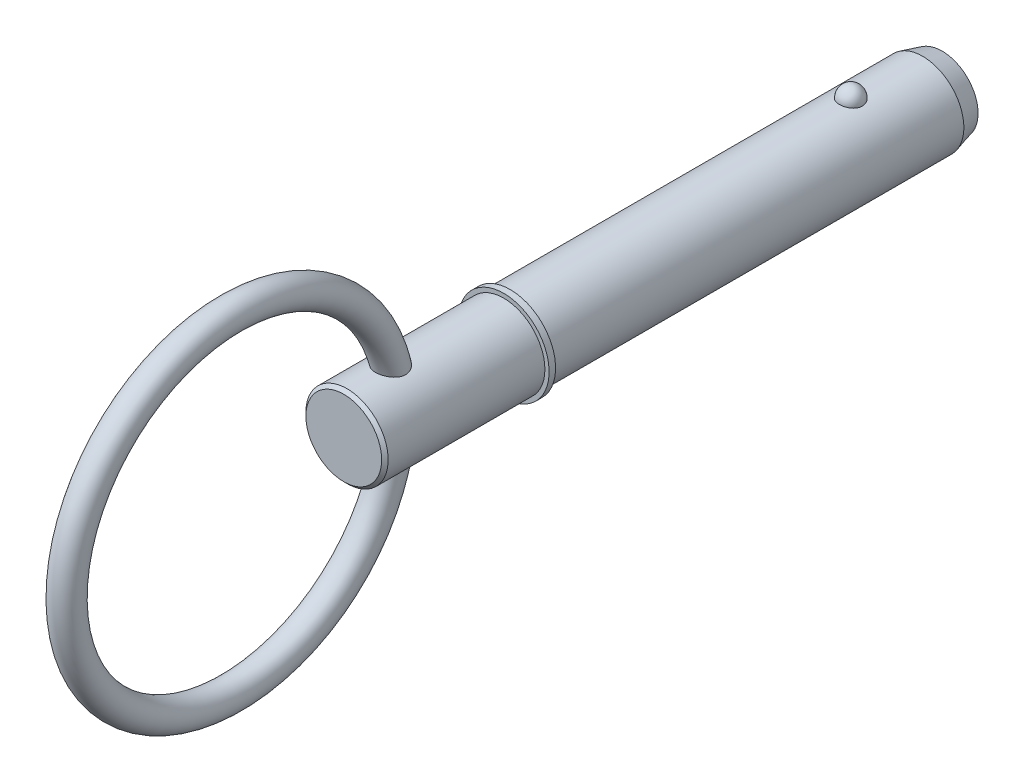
ISO-10303-21;
HEADER;
FILE_DESCRIPTION(('STEP AP214'),'2;1');
FILE_NAME('part.step','',(''),(''),'','','');
FILE_SCHEMA(('AUTOMOTIVE_DESIGN { 1 0 10303 214 1 1 1 1 }'));
ENDSEC;
DATA;
#1=APPLICATION_CONTEXT('core data for automotive mechanical design processes');
#2=APPLICATION_PROTOCOL_DEFINITION('international standard','automotive_design',2000,#1);
#3=PRODUCT_CONTEXT('',#1,'mechanical');
#4=PRODUCT('Part','Part','',(#3));
#5=PRODUCT_RELATED_PRODUCT_CATEGORY('part','',(#4));
#6=PRODUCT_DEFINITION_FORMATION('','',#4);
#7=PRODUCT_DEFINITION_CONTEXT('part definition',#1,'design');
#8=PRODUCT_DEFINITION('design','',#6,#7);
#9=PRODUCT_DEFINITION_SHAPE('','',#8);
#10=(LENGTH_UNIT() NAMED_UNIT(*) SI_UNIT(.MILLI.,.METRE.));
#11=(NAMED_UNIT(*) PLANE_ANGLE_UNIT() SI_UNIT($,.RADIAN.));
#12=(NAMED_UNIT(*) SI_UNIT($,.STERADIAN.) SOLID_ANGLE_UNIT());
#13=UNCERTAINTY_MEASURE_WITH_UNIT(LENGTH_MEASURE(1.E-05),#10,'distance_accuracy_value','');
#14=(GEOMETRIC_REPRESENTATION_CONTEXT(3) GLOBAL_UNCERTAINTY_ASSIGNED_CONTEXT((#13)) GLOBAL_UNIT_ASSIGNED_CONTEXT((#10,
#11,#12)) REPRESENTATION_CONTEXT('',''));
#15=CARTESIAN_POINT('',(0.,0.,0.));
#16=DIRECTION('',(0.,0.,1.));
#17=DIRECTION('',(1.,0.,0.));
#18=AXIS2_PLACEMENT_3D('',#15,#16,#17);
#19=CARTESIAN_POINT('',(0.,0.,50.8));
#20=DIRECTION('',(0.,0.,-1.));
#21=DIRECTION('',(-1.,0.,0.));
#22=AXIS2_PLACEMENT_3D('',#19,#20,#21);
#23=CYLINDRICAL_SURFACE('',#22,6.35);
#24=CARTESIAN_POINT('',(1.76243001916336,6.10051968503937,-1.78));
#25=CARTESIAN_POINT('',(1.76242835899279,6.10052111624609,-1.68050311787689));
#26=CARTESIAN_POINT('',(1.75431593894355,6.1028816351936,-1.58098521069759));
#27=CARTESIAN_POINT('',(1.72206027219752,6.11206037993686,-1.38476972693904));
#28=CARTESIAN_POINT('',(1.69791106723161,6.11888026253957,-1.28807321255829));
#29=CARTESIAN_POINT('',(1.63419596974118,6.13620287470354,-1.10029899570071));
#30=CARTESIAN_POINT('',(1.59463684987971,6.14670398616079,-1.00921884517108));
#31=CARTESIAN_POINT('',(1.50108569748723,6.17021534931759,-0.835161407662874));
#32=CARTESIAN_POINT('',(1.44709398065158,6.18322554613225,-0.752183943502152));
#33=CARTESIAN_POINT('',(1.3257243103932,6.21038081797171,-0.596209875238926));
#34=CARTESIAN_POINT('',(1.2582815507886,6.22453118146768,-0.523264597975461));
#35=CARTESIAN_POINT('',(1.11191624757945,6.25233390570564,-0.389855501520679));
#36=CARTESIAN_POINT('',(1.03299369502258,6.26598626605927,-0.329391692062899));
#37=CARTESIAN_POINT('',(0.866022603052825,6.29123226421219,-0.222793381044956));
#38=CARTESIAN_POINT('',(0.778000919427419,6.30283170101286,-0.176618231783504));
#39=CARTESIAN_POINT('',(0.59510847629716,6.32272058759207,-0.0996905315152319));
#40=CARTESIAN_POINT('',(0.500238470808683,6.33101040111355,-0.0689362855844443));
#41=CARTESIAN_POINT('',(0.308164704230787,6.34323464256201,-0.0241595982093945));
#42=CARTESIAN_POINT('',(0.211033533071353,6.34724467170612,-0.00984637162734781));
#43=CARTESIAN_POINT('',(0.0156629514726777,6.3507318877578,0.00262058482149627));
#44=CARTESIAN_POINT('',(-0.0825763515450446,6.35020951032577,0.000775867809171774));
#45=CARTESIAN_POINT('',(-0.275890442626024,6.34473055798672,-0.018872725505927));
#46=CARTESIAN_POINT('',(-0.370990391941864,6.3398374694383,-0.0364481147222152));
#47=CARTESIAN_POINT('',(-0.556805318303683,6.32622723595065,-0.0867447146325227));
#48=CARTESIAN_POINT('',(-0.647520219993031,6.31751002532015,-0.119466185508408));
#49=CARTESIAN_POINT('',(-0.822606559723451,6.29711353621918,-0.199386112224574));
#50=CARTESIAN_POINT('',(-0.906938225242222,6.28541739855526,-0.246667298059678));
#51=CARTESIAN_POINT('',(-1.06646479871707,6.26032612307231,-0.354365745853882));
#52=CARTESIAN_POINT('',(-1.14165877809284,6.24693081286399,-0.414784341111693));
#53=CARTESIAN_POINT('',(-1.2823514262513,6.21959142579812,-0.548435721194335));
#54=CARTESIAN_POINT('',(-1.34763761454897,6.2056417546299,-0.621891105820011));
#55=CARTESIAN_POINT('',(-1.4651153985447,6.17896241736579,-0.778815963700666));
#56=CARTESIAN_POINT('',(-1.51730606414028,6.16623283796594,-0.862286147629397));
#57=CARTESIAN_POINT('',(-1.60782211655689,6.14325839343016,-1.0379915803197));
#58=CARTESIAN_POINT('',(-1.64598111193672,6.13304379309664,-1.13031660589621));
#59=CARTESIAN_POINT('',(-1.70661885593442,6.11644899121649,-1.32030667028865));
#60=CARTESIAN_POINT('',(-1.72909805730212,6.11006867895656,-1.41797155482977));
#61=CARTESIAN_POINT('',(-1.75775019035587,6.1018881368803,-1.61543246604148));
#62=CARTESIAN_POINT('',(-1.76399136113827,6.10006874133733,-1.71521779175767));
#63=CARTESIAN_POINT('',(-1.76020715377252,6.10116172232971,-1.91445126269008));
#64=CARTESIAN_POINT('',(-1.75018221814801,6.10407397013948,-2.01389941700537));
#65=CARTESIAN_POINT('',(-1.71421005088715,6.11427232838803,-2.20912106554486));
#66=CARTESIAN_POINT('',(-1.68834262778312,6.12153651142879,-2.30491043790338));
#67=CARTESIAN_POINT('',(-1.62139543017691,6.1396067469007,-2.49066180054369));
#68=CARTESIAN_POINT('',(-1.5803150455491,6.15041294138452,-2.58062355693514));
#69=CARTESIAN_POINT('',(-1.48369112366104,6.17443456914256,-2.75271428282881));
#70=CARTESIAN_POINT('',(-1.42806998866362,6.18766281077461,-2.83479789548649));
#71=CARTESIAN_POINT('',(-1.30386620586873,6.21501934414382,-2.98832532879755));
#72=CARTESIAN_POINT('',(-1.23528306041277,6.22914767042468,-3.05976874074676));
#73=CARTESIAN_POINT('',(-1.08663999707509,6.25679135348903,-3.19029656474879));
#74=CARTESIAN_POINT('',(-1.00653826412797,6.27030422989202,-3.24933392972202));
#75=CARTESIAN_POINT('',(-0.837212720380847,6.29514770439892,-3.35304657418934));
#76=CARTESIAN_POINT('',(-0.747989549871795,6.30647845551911,-3.39772286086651));
#77=CARTESIAN_POINT('',(-0.564098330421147,6.32556124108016,-3.47096393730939));
#78=CARTESIAN_POINT('',(-0.469512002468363,6.33335611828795,-3.49972259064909));
#79=CARTESIAN_POINT('',(-0.27663389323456,6.34470628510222,-3.54113722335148));
#80=CARTESIAN_POINT('',(-0.17834256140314,6.34826208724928,-3.55379514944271));
#81=CARTESIAN_POINT('',(0.0171660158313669,6.35071525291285,-3.56255473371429));
#82=CARTESIAN_POINT('',(0.114368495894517,6.34969931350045,-3.55896450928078));
#83=CARTESIAN_POINT('',(0.306746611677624,6.34331695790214,-3.53603383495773));
#84=CARTESIAN_POINT('',(0.401922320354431,6.33795069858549,-3.51669395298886));
#85=CARTESIAN_POINT('',(0.587203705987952,6.32347219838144,-3.4629173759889));
#86=CARTESIAN_POINT('',(0.677327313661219,6.31437430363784,-3.42853846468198));
#87=CARTESIAN_POINT('',(0.850462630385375,6.29339543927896,-3.34564128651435));
#88=CARTESIAN_POINT('',(0.933473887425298,6.2815142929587,-3.29712212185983));
#89=CARTESIAN_POINT('',(1.09144542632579,6.25601750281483,-3.18638742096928));
#90=CARTESIAN_POINT('',(1.16626195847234,6.24237795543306,-3.12397237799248));
#91=CARTESIAN_POINT('',(1.304448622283,6.21497285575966,-2.98755865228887));
#92=CARTESIAN_POINT('',(1.36781676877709,6.20120728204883,-2.91355796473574));
#93=CARTESIAN_POINT('',(1.48252779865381,6.17479923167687,-2.75456133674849));
#94=CARTESIAN_POINT('',(1.53364167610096,6.16218052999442,-2.66939613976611));
#95=CARTESIAN_POINT('',(1.62109397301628,6.13975602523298,-2.49147502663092));
#96=CARTESIAN_POINT('',(1.657437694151,6.12994921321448,-2.39872184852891));
#97=CARTESIAN_POINT('',(1.71127844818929,6.11512175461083,-2.21887622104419));
#98=CARTESIAN_POINT('',(1.73042646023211,6.10968903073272,-2.13230770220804));
#99=CARTESIAN_POINT('',(1.75600284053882,6.10238739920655,-1.95716498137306));
#100=CARTESIAN_POINT('',(1.76243149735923,6.10051841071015,-1.86859082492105));
#101=CARTESIAN_POINT('',(1.76243001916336,6.10051968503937,-1.78));
#102=B_SPLINE_CURVE_WITH_KNOTS('',3,(#24,#25,#26,#27,#28,#29,#30,#31,#32,#33,#34,#35,#36,#37,
#38,#39,#40,#41,#42,#43,#44,#45,#46,#47,#48,#49,#50,#51,#52,#53,#54,#55,#56,#57,#58,#59,#60,#61,
#62,#63,#64,#65,#66,#67,#68,#69,#70,#71,#72,#73,#74,#75,#76,#77,#78,#79,#80,#81,#82,#83,#84,#85,
#86,#87,#88,#89,#90,#91,#92,#93,#94,#95,#96,#97,#98,#99,#100,#101),.UNSPECIFIED.,.T.,.F.,(4,2,2,
2,2,2,2,2,2,2,2,2,2,2,2,2,2,2,2,2,2,2,2,2,2,2,2,2,2,2,2,2,2,2,2,2,2,2,4),(0.,0.298172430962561,
0.596455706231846,0.894608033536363,1.19275383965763,1.49237238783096,1.79199116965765,
2.09074960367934,2.38947519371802,2.68283180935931,2.97616022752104,3.26529599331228,
3.5544367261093,3.84525169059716,4.13609618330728,4.43249276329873,4.72891038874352,
5.02873757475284,5.32855610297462,5.62711261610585,5.92566100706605,6.22271765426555,
6.519786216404,6.81847366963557,7.11717259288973,7.41698459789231,7.71677557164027,
8.01283014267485,8.30884891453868,8.59927798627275,8.88969658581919,9.17900899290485,
9.46833977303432,9.76212836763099,10.0559678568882,10.3549321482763,10.6537890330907,
10.9192841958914,11.1847733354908),.UNSPECIFIED.);
#103=CARTESIAN_POINT('',(1.76243001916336,6.10051968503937,-1.78));
#104=VERTEX_POINT('',#103);
#105=EDGE_CURVE('E102',#104,#104,#102,.T.);
#106=ORIENTED_EDGE('',*,*,#105,.T.);
#107=EDGE_LOOP('',(#106));
#108=FACE_BOUND('',#107,.T.);
#109=CARTESIAN_POINT('',(0.,0.,-12.8799999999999));
#110=DIRECTION('',(0.,0.,-1.));
#111=DIRECTION('',(-1.,0.,0.));
#112=AXIS2_PLACEMENT_3D('',#109,#110,#111);
#113=CIRCLE('',#112,6.35);
#114=CARTESIAN_POINT('',(-6.35,0.,-12.8799999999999));
#115=VERTEX_POINT('',#114);
#116=EDGE_CURVE('E110',#115,#115,#113,.F.);
#117=ORIENTED_EDGE('',*,*,#116,.T.);
#118=EDGE_LOOP('',(#117));
#119=FACE_BOUND('',#118,.T.);
#120=CARTESIAN_POINT('',(0.,0.,50.8));
#121=DIRECTION('',(0.,0.,1.));
#122=DIRECTION('',(1.,0.,0.));
#123=AXIS2_PLACEMENT_3D('',#120,#121,#122);
#124=CIRCLE('',#123,6.35);
#125=CARTESIAN_POINT('',(6.35,0.,50.8));
#126=VERTEX_POINT('',#125);
#127=EDGE_CURVE('E108',#126,#126,#124,.T.);
#128=ORIENTED_EDGE('',*,*,#127,.F.);
#129=EDGE_LOOP('',(#128));
#130=FACE_BOUND('',#129,.T.);
#131=ADVANCED_FACE('F39',(#108,#119,#130),#23,.T.);
#132=CARTESIAN_POINT('',(0.,0.,-15.88));
#133=DIRECTION('',(0.,0.,-1.));
#134=DIRECTION('',(-1.,0.,0.));
#135=AXIS2_PLACEMENT_3D('',#132,#133,#134);
#136=PLANE('',#135);
#137=CARTESIAN_POINT('',(0.,0.,-15.88));
#138=DIRECTION('',(0.,0.,-1.));
#139=DIRECTION('',(-1.,0.,0.));
#140=AXIS2_PLACEMENT_3D('',#137,#138,#139);
#141=CIRCLE('',#140,5.54615242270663);
#142=CARTESIAN_POINT('',(-5.54615242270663,0.,-15.88));
#143=VERTEX_POINT('',#142);
#144=EDGE_CURVE('E143',#143,#143,#141,.T.);
#145=ORIENTED_EDGE('',*,*,#144,.T.);
#146=EDGE_LOOP('',(#145));
#147=FACE_BOUND('',#146,.T.);
#148=ADVANCED_FACE('F88',(#147),#136,.T.);
#149=CARTESIAN_POINT('',(0.,0.,-15.88));
#150=DIRECTION('',(0.,0.,1.));
#151=DIRECTION('',(1.,0.,0.));
#152=AXIS2_PLACEMENT_3D('',#149,#150,#151);
#153=CONICAL_SURFACE('',#152,5.54615242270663,0.261799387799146);
#154=ORIENTED_EDGE('',*,*,#116,.F.);
#155=EDGE_LOOP('',(#154));
#156=FACE_BOUND('',#155,.T.);
#157=ORIENTED_EDGE('',*,*,#144,.F.);
#158=EDGE_LOOP('',(#157));
#159=FACE_BOUND('',#158,.T.);
#160=ADVANCED_FACE('F94',(#156,#159),#153,.T.);
#161=CARTESIAN_POINT('',(0.,6.35,-1.78));
#162=DIRECTION('',(0.,1.,0.));
#163=DIRECTION('',(0.,0.,1.));
#164=AXIS2_PLACEMENT_3D('',#161,#162,#163);
#165=SPHERICAL_SURFACE('',#164,1.78);
#166=ORIENTED_EDGE('',*,*,#105,.F.);
#167=EDGE_LOOP('',(#166));
#168=FACE_BOUND('',#167,.T.);
#169=ADVANCED_FACE('F113',(#168),#165,.T.);
#170=CARTESIAN_POINT('',(0.,0.,50.8));
#171=DIRECTION('',(0.,0.,-1.));
#172=DIRECTION('',(-1.,0.,0.));
#173=AXIS2_PLACEMENT_3D('',#170,#171,#172);
#174=PLANE('',#173);
#175=ORIENTED_EDGE('',*,*,#127,.T.);
#176=EDGE_LOOP('',(#175));
#177=FACE_BOUND('',#176,.T.);
#178=CARTESIAN_POINT('',(0.,0.,50.8));
#179=DIRECTION('',(0.,0.,-1.));
#180=DIRECTION('',(-1.,0.,0.));
#181=AXIS2_PLACEMENT_3D('',#178,#179,#180);
#182=CIRCLE('',#181,7.);
#183=CARTESIAN_POINT('',(-7.,0.,50.8));
#184=VERTEX_POINT('',#183);
#185=EDGE_CURVE('E109',#184,#184,#182,.T.);
#186=ORIENTED_EDGE('',*,*,#185,.T.);
#187=EDGE_LOOP('',(#186));
#188=FACE_BOUND('',#187,.T.);
#189=ADVANCED_FACE('F117',(#177,#188),#174,.T.);
#190=CARTESIAN_POINT('',(0.,0.,33.7287874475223));
#191=DIRECTION('',(0.,0.,-1.));
#192=DIRECTION('',(-1.,0.,0.));
#193=AXIS2_PLACEMENT_3D('',#190,#191,#192);
#194=CYLINDRICAL_SURFACE('',#193,7.);
#195=CARTESIAN_POINT('',(0.,0.,51.8));
#196=DIRECTION('',(0.,0.,-1.));
#197=DIRECTION('',(-1.,0.,0.));
#198=AXIS2_PLACEMENT_3D('',#195,#196,#197);
#199=CIRCLE('',#198,7.);
#200=CARTESIAN_POINT('',(-7.,0.,51.8));
#201=VERTEX_POINT('',#200);
#202=EDGE_CURVE('E134',#201,#201,#199,.T.);
#203=ORIENTED_EDGE('',*,*,#202,.T.);
#204=EDGE_LOOP('',(#203));
#205=FACE_BOUND('',#204,.T.);
#206=ORIENTED_EDGE('',*,*,#185,.F.);
#207=EDGE_LOOP('',(#206));
#208=FACE_BOUND('',#207,.T.);
#209=ADVANCED_FACE('F121',(#205,#208),#194,.T.);
#210=CARTESIAN_POINT('',(0.,7.,51.8));
#211=DIRECTION('',(0.,0.,1.));
#212=DIRECTION('',(1.,0.,0.));
#213=AXIS2_PLACEMENT_3D('',#210,#211,#212);
#214=PLANE('',#213);
#215=CARTESIAN_POINT('',(0.,0.,51.8));
#216=DIRECTION('',(0.,0.,1.));
#217=DIRECTION('',(1.,0.,0.));
#218=AXIS2_PLACEMENT_3D('',#215,#216,#217);
#219=CIRCLE('',#218,6.35);
#220=CARTESIAN_POINT('',(6.35,0.,51.8));
#221=VERTEX_POINT('',#220);
#222=EDGE_CURVE('E112',#221,#221,#219,.T.);
#223=ORIENTED_EDGE('',*,*,#222,.F.);
#224=EDGE_LOOP('',(#223));
#225=FACE_BOUND('',#224,.T.);
#226=ORIENTED_EDGE('',*,*,#202,.F.);
#227=EDGE_LOOP('',(#226));
#228=FACE_BOUND('',#227,.T.);
#229=ADVANCED_FACE('F85',(#225,#228),#214,.T.);
#230=CARTESIAN_POINT('',(0.,0.,76.5));
#231=DIRECTION('',(0.,0.,-1.));
#232=DIRECTION('',(-1.,0.,0.));
#233=AXIS2_PLACEMENT_3D('',#230,#231,#232);
#234=CYLINDRICAL_SURFACE('',#233,6.35);
#235=CARTESIAN_POINT('',(-1.08120660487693,-6.25727514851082,67.2515811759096));
#236=CARTESIAN_POINT('',(-0.970724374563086,-6.27636409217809,67.1938798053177));
#237=CARTESIAN_POINT('',(-0.855136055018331,-6.29329984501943,67.1452195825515));
#238=CARTESIAN_POINT('',(-0.616958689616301,-6.32109419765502,67.0670559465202));
#239=CARTESIAN_POINT('',(-0.494369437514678,-6.3319526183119,67.0375530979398));
#240=CARTESIAN_POINT('',(-0.245606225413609,-6.34647141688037,66.9983673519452));
#241=CARTESIAN_POINT('',(-0.119431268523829,-6.35012977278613,66.9886900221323));
#242=CARTESIAN_POINT('',(0.132849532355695,-6.34986313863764,66.9894002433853));
#243=CARTESIAN_POINT('',(0.258955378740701,-6.34593843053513,66.9997870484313));
#244=CARTESIAN_POINT('',(0.50691297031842,-6.33094785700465,67.0402854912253));
#245=CARTESIAN_POINT('',(0.628781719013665,-6.31991516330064,67.0703055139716));
#246=CARTESIAN_POINT('',(0.865486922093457,-6.29187143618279,67.1493088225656));
#247=CARTESIAN_POINT('',(0.980322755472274,-6.27485987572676,67.198293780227));
#248=CARTESIAN_POINT('',(1.20050616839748,-6.23649440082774,67.3145408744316));
#249=CARTESIAN_POINT('',(1.30578867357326,-6.21511352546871,67.3819174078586));
#250=CARTESIAN_POINT('',(1.50311440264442,-6.17036440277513,67.5333596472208));
#251=CARTESIAN_POINT('',(1.59515714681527,-6.14699608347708,67.6174259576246));
#252=CARTESIAN_POINT('',(1.76326863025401,-6.10090072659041,67.8002474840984));
#253=CARTESIAN_POINT('',(1.83935482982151,-6.07817301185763,67.8989864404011));
#254=CARTESIAN_POINT('',(1.97338559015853,-6.03599268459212,68.108703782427));
#255=CARTESIAN_POINT('',(2.03133638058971,-6.01653894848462,68.2196779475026));
#256=CARTESIAN_POINT('',(2.1259120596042,-5.98376466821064,68.447018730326));
#257=CARTESIAN_POINT('',(2.16315310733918,-5.97026970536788,68.5631040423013));
#258=CARTESIAN_POINT('',(2.21830650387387,-5.94999923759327,68.8003187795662));
#259=CARTESIAN_POINT('',(2.2362211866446,-5.94322292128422,68.9214475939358));
#260=CARTESIAN_POINT('',(2.25273772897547,-5.93698111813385,69.1632812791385));
#261=CARTESIAN_POINT('',(2.25163224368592,-5.93740484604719,69.2839640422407));
#262=CARTESIAN_POINT('',(2.23167546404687,-5.94493297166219,69.5236203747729));
#263=CARTESIAN_POINT('',(2.21281883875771,-5.9520393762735,69.6425934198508));
#264=CARTESIAN_POINT('',(2.15679576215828,-5.97257680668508,69.8838367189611));
#265=CARTESIAN_POINT('',(2.11851138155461,-5.98639144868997,70.0058128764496));
#266=CARTESIAN_POINT('',(2.02470263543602,-6.01876484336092,70.2422848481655));
#267=CARTESIAN_POINT('',(1.96916879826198,-6.03732620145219,70.3567765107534));
#268=CARTESIAN_POINT('',(1.8352662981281,-6.07945247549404,70.5879958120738));
#269=CARTESIAN_POINT('',(1.75507038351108,-6.10334207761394,70.7036110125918));
#270=CARTESIAN_POINT('',(1.57657889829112,-6.15186551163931,70.9198949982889));
#271=CARTESIAN_POINT('',(1.47827192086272,-6.17649980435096,71.0205542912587));
#272=CARTESIAN_POINT('',(1.26306696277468,-6.22410762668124,71.2050235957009));
#273=CARTESIAN_POINT('',(1.14585214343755,-6.24704086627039,71.2884783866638));
#274=CARTESIAN_POINT('',(0.896825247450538,-6.28760987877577,71.431400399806));
#275=CARTESIAN_POINT('',(0.765036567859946,-6.30525397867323,71.4909053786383));
#276=CARTESIAN_POINT('',(0.509454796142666,-6.330648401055,71.5752631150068));
#277=CARTESIAN_POINT('',(0.386964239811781,-6.33940909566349,71.6036959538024));
#278=CARTESIAN_POINT('',(0.200813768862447,-6.3471308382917,71.6286800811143));
#279=CARTESIAN_POINT('',(0.138353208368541,-6.34880140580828,71.634063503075));
#280=CARTESIAN_POINT('',(0.0131841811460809,-6.35029448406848,71.6388738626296));
#281=CARTESIAN_POINT('',(-0.04952425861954,-6.35011719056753,71.6383014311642));
#282=CARTESIAN_POINT('',(-0.219860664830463,-6.34710452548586,71.6285979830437));
#283=CARTESIAN_POINT('',(-0.327176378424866,-6.34243953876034,71.6135767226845));
#284=CARTESIAN_POINT('',(-0.537619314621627,-6.32808248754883,71.566673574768));
#285=CARTESIAN_POINT('',(-0.640746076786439,-6.31838987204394,71.5347898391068));
#286=CARTESIAN_POINT('',(-0.841795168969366,-6.29478075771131,71.4553379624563));
#287=CARTESIAN_POINT('',(-0.939631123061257,-6.28081033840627,71.40756888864));
#288=CARTESIAN_POINT('',(-1.12690564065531,-6.2499288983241,71.2985138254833));
#289=CARTESIAN_POINT('',(-1.21634109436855,-6.2330167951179,71.237222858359));
#290=CARTESIAN_POINT('',(-1.3971303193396,-6.19517308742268,71.0940397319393));
#291=CARTESIAN_POINT('',(-1.48711596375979,-6.17400700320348,71.0104839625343));
#292=CARTESIAN_POINT('',(-1.65373642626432,-6.13148145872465,70.830996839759));
#293=CARTESIAN_POINT('',(-1.73036130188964,-6.11012186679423,70.7350563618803));
#294=CARTESIAN_POINT('',(-1.87908981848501,-6.06616529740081,70.5186208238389));
#295=CARTESIAN_POINT('',(-1.94902044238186,-6.04382072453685,70.3965721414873));
#296=CARTESIAN_POINT('',(-2.06849605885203,-6.00398244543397,70.1420700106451));
#297=CARTESIAN_POINT('',(-2.11803457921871,-5.98649027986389,70.0096132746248));
#298=CARTESIAN_POINT('',(-2.19551930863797,-5.95851933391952,69.7345936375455));
#299=CARTESIAN_POINT('',(-2.22297667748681,-5.94819998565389,69.5918743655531));
#300=CARTESIAN_POINT('',(-2.25222139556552,-5.93719450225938,69.3034800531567));
#301=CARTESIAN_POINT('',(-2.25403508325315,-5.93649848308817,69.1578081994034));
#302=CARTESIAN_POINT('',(-2.23178480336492,-5.94489150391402,68.8838044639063));
#303=CARTESIAN_POINT('',(-2.21035650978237,-5.95298402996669,68.7552268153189));
#304=CARTESIAN_POINT('',(-2.14565882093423,-5.97660650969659,68.5044089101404));
#305=CARTESIAN_POINT('',(-2.10239634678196,-5.99213410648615,68.3821666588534));
#306=CARTESIAN_POINT('',(-1.99913159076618,-6.02732890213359,68.1567478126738));
#307=CARTESIAN_POINT('',(-1.94060271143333,-6.04660536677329,68.0528298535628));
#308=CARTESIAN_POINT('',(-1.80736340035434,-6.08775699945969,67.856534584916));
#309=CARTESIAN_POINT('',(-1.73265259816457,-6.10963222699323,67.7641575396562));
#310=CARTESIAN_POINT('',(-1.56865095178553,-6.15378470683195,67.5926034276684));
#311=CARTESIAN_POINT('',(-1.47928749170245,-6.17606344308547,67.5134962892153));
#312=CARTESIAN_POINT('',(-1.28858731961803,-6.21864788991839,67.3706753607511));
#313=CARTESIAN_POINT('',(-1.18724893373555,-6.23895332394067,67.3069637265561));
#314=CARTESIAN_POINT('',(-1.08120660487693,-6.25727514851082,67.2515811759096));
#315=B_SPLINE_CURVE_WITH_KNOTS('',3,(#235,#236,#237,#238,#239,#240,#241,#242,#243,#244,#245,
#246,#247,#248,#249,#250,#251,#252,#253,#254,#255,#256,#257,#258,#259,#260,#261,#262,#263,#264,
#265,#266,#267,#268,#269,#270,#271,#272,#273,#274,#275,#276,#277,#278,#279,#280,#281,#282,#283,
#284,#285,#286,#287,#288,#289,#290,#291,#292,#293,#294,#295,#296,#297,#298,#299,#300,#301,#302,
#303,#304,#305,#306,#307,#308,#309,#310,#311,#312,#313,#314),.UNSPECIFIED.,.T.,.F.,(4,2,2,2,2,2,
2,2,2,2,2,2,2,2,2,2,2,2,2,2,2,2,2,2,2,2,2,2,2,2,2,2,2,2,2,2,2,2,2,4),(0.,0.377861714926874,
0.755734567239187,1.13371352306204,1.51167842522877,1.88789208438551,2.26413891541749,
2.64278156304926,3.02143792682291,3.39967776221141,3.77778752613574,4.14394628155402,
4.51006081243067,4.87054720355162,5.23114188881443,5.61534494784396,5.99975934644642,
6.42600522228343,6.85252048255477,7.28711365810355,7.72101899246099,8.0966613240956,
8.28452949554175,8.47237776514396,8.79607953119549,9.11981678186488,9.44781545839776,
9.77593508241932,10.1483085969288,10.5209580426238,10.9463240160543,11.3718248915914,
11.8065046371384,12.2407378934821,12.6304236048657,13.0199858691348,13.3807583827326,
13.7415391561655,14.104165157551,14.4668419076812),.UNSPECIFIED.);
#316=CARTESIAN_POINT('',(-1.08120660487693,-6.25727514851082,67.2515811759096));
#317=VERTEX_POINT('',#316);
#318=EDGE_CURVE('E10',#317,#317,#315,.T.);
#319=ORIENTED_EDGE('',*,*,#318,.F.);
#320=EDGE_LOOP('',(#319));
#321=FACE_BOUND('',#320,.T.);
#322=CARTESIAN_POINT('',(-1.08120660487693,6.25727514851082,67.2515811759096));
#323=CARTESIAN_POINT('',(-1.19093168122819,6.23831652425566,67.308887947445));
#324=CARTESIAN_POINT('',(-1.29562751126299,6.21723224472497,67.3751167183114));
#325=CARTESIAN_POINT('',(-1.49211272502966,6.17302620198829,67.524020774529));
#326=CARTESIAN_POINT('',(-1.58390200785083,6.14990442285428,67.6066961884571));
#327=CARTESIAN_POINT('',(-1.75209695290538,6.10411985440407,67.7867778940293));
#328=CARTESIAN_POINT('',(-1.82848346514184,6.08145766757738,67.8842022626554));
#329=CARTESIAN_POINT('',(-1.96346259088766,6.0392331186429,68.0912733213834));
#330=CARTESIAN_POINT('',(-2.02206050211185,6.01966983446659,68.2009163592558));
#331=CARTESIAN_POINT('',(-2.11860444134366,5.9863659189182,68.4265649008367));
#332=CARTESIAN_POINT('',(-2.15701637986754,5.97249571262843,68.5423519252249));
#333=CARTESIAN_POINT('',(-2.21449304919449,5.95142584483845,68.7791911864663));
#334=CARTESIAN_POINT('',(-2.23356015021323,5.94422536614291,68.9002427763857));
#335=CARTESIAN_POINT('',(-2.25228141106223,5.93715610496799,69.1419445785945));
#336=CARTESIAN_POINT('',(-2.25225786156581,5.93716560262,69.2625670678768));
#337=CARTESIAN_POINT('',(-2.2344206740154,5.94389982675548,69.5022777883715));
#338=CARTESIAN_POINT('',(-2.21660184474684,5.95062651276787,69.6213655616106));
#339=CARTESIAN_POINT('',(-2.16272689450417,5.97042554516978,69.8627056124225));
#340=CARTESIAN_POINT('',(-2.12559286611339,5.98387086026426,69.9846848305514));
#341=CARTESIAN_POINT('',(-2.03409944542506,6.0155857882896,70.221342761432));
#342=CARTESIAN_POINT('',(-1.97973080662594,6.03385799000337,70.3360175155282));
#343=CARTESIAN_POINT('',(-1.84828023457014,6.07549301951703,70.5678654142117));
#344=CARTESIAN_POINT('',(-1.76936622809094,6.09919386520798,70.6839437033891));
#345=CARTESIAN_POINT('',(-1.59344783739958,6.14749881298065,70.9014208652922));
#346=CARTESIAN_POINT('',(-1.49643151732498,6.17210350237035,71.0028099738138));
#347=CARTESIAN_POINT('',(-1.28333318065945,6.21994692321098,71.1895083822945));
#348=CARTESIAN_POINT('',(-1.16685721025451,6.24314005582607,71.2743845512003));
#349=CARTESIAN_POINT('',(-0.919062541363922,6.2843871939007,71.4203440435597));
#350=CARTESIAN_POINT('',(-0.787766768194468,6.30244898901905,71.4814634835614));
#351=CARTESIAN_POINT('',(-0.532335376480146,6.32876911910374,71.5691112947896));
#352=CARTESIAN_POINT('',(-0.409516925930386,6.33800211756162,71.5991235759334));
#353=CARTESIAN_POINT('',(-0.222636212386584,6.34640533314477,71.6263386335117));
#354=CARTESIAN_POINT('',(-0.159893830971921,6.34829860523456,71.6324428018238));
#355=CARTESIAN_POINT('',(-0.0340877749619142,6.35021985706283,71.6386341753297));
#356=CARTESIAN_POINT('',(0.0289758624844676,6.35024804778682,71.6387220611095));
#357=CARTESIAN_POINT('',(0.200008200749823,6.34776620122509,71.630732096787));
#358=CARTESIAN_POINT('',(0.307730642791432,6.34342046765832,71.6167500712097));
#359=CARTESIAN_POINT('',(0.51913450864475,6.32963338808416,71.5717653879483));
#360=CARTESIAN_POINT('',(0.622815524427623,6.3201915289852,71.5407610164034));
#361=CARTESIAN_POINT('',(0.824580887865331,6.2970603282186,71.4630869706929));
#362=CARTESIAN_POINT('',(0.922611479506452,6.28333629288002,71.4162890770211));
#363=CARTESIAN_POINT('',(1.11039970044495,6.2528858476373,71.3091226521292));
#364=CARTESIAN_POINT('',(1.20015435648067,6.23615836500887,71.2487492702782));
#365=CARTESIAN_POINT('',(1.38155818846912,6.19866747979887,71.1076024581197));
#366=CARTESIAN_POINT('',(1.47187645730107,6.17766310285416,71.0251847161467));
#367=CARTESIAN_POINT('',(1.6393362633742,6.135352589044,70.8479469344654));
#368=CARTESIAN_POINT('',(1.71646809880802,6.11404624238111,70.7531178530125));
#369=CARTESIAN_POINT('',(1.86660460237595,6.07002946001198,70.538851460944));
#370=CARTESIAN_POINT('',(1.93743710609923,6.04755477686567,70.4178347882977));
#371=CARTESIAN_POINT('',(2.0589430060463,6.00727604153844,70.1652808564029));
#372=CARTESIAN_POINT('',(2.1096091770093,5.98947366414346,70.033739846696));
#373=CARTESIAN_POINT('',(2.18982014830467,5.96062717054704,69.7597589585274));
#374=CARTESIAN_POINT('',(2.21877575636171,5.94977267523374,69.6171236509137));
#375=CARTESIAN_POINT('',(2.2510475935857,5.93764416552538,69.3285958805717));
#376=CARTESIAN_POINT('',(2.25438985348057,5.93636042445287,69.1827068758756));
#377=CARTESIAN_POINT('',(2.23498011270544,5.9436885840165,68.9077311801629));
#378=CARTESIAN_POINT('',(2.21482640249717,5.95131530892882,68.7784341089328));
#379=CARTESIAN_POINT('',(2.15248760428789,5.97414352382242,68.5259695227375));
#380=CARTESIAN_POINT('',(2.11031020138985,5.98934237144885,68.4027998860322));
#381=CARTESIAN_POINT('',(2.00904610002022,6.02402214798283,68.1757832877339));
#382=CARTESIAN_POINT('',(1.95150192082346,6.04308594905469,68.0711789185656));
#383=CARTESIAN_POINT('',(1.82009972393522,6.08395083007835,67.8733823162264));
#384=CARTESIAN_POINT('',(1.74624088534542,6.10575204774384,67.7801906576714));
#385=CARTESIAN_POINT('',(1.58309476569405,6.15008431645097,67.6061646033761));
#386=CARTESIAN_POINT('',(1.49360904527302,6.17262128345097,67.5255180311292));
#387=CARTESIAN_POINT('',(1.30231515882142,6.21579297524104,67.3798366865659));
#388=CARTESIAN_POINT('',(1.20050521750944,6.23642742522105,67.3148041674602));
#389=CARTESIAN_POINT('',(0.98378657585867,6.27432316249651,67.1998596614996));
#390=CARTESIAN_POINT('',(0.868563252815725,6.29145558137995,67.1504972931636));
#391=CARTESIAN_POINT('',(0.630994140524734,6.31970327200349,67.0708857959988));
#392=CARTESIAN_POINT('',(0.508648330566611,6.33081852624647,67.0406367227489));
#393=CARTESIAN_POINT('',(0.259933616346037,6.34590352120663,66.9998795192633));
#394=CARTESIAN_POINT('',(0.133554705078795,6.34985380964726,66.9894251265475));
#395=CARTESIAN_POINT('',(-0.119270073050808,6.35013815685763,66.9886676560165));
#396=CARTESIAN_POINT('',(-0.245715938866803,6.34647233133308,66.9983642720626));
#397=CARTESIAN_POINT('',(-0.494670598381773,6.33192772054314,67.0376209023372));
#398=CARTESIAN_POINT('',(-0.617189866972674,6.3210701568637,67.0671224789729));
#399=CARTESIAN_POINT('',(-0.855240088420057,6.29328476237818,67.1452630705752));
#400=CARTESIAN_POINT('',(-0.970770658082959,6.27635659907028,67.1939031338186));
#401=CARTESIAN_POINT('',(-1.08120660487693,6.25727514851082,67.2515811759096));
#402=B_SPLINE_CURVE_WITH_KNOTS('',3,(#322,#323,#324,#325,#326,#327,#328,#329,#330,#331,#332,
#333,#334,#335,#336,#337,#338,#339,#340,#341,#342,#343,#344,#345,#346,#347,#348,#349,#350,#351,
#352,#353,#354,#355,#356,#357,#358,#359,#360,#361,#362,#363,#364,#365,#366,#367,#368,#369,#370,
#371,#372,#373,#374,#375,#376,#377,#378,#379,#380,#381,#382,#383,#384,#385,#386,#387,#388,#389,
#390,#391,#392,#393,#394,#395,#396,#397,#398,#399,#400,#401),.UNSPECIFIED.,.T.,.F.,(4,2,2,2,2,2,
2,2,2,2,2,2,2,2,2,2,2,2,2,2,2,2,2,2,2,2,2,2,2,2,2,2,2,2,2,2,2,2,2,4),(0.,0.375258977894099,
0.750520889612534,1.1262465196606,1.50186014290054,1.86837438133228,2.2348437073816,
2.59512638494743,2.95551419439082,3.33859924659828,3.7218901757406,4.14704029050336,
4.57247172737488,5.00788576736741,5.4426352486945,5.82040093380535,6.00932292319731,
6.19822354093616,6.52266071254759,6.84713055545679,7.17430063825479,7.50158780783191,
7.87233275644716,8.24334931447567,8.66748794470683,9.09177840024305,9.52720369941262,
9.96218641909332,10.3532895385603,10.7442562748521,11.1052784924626,11.4663188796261,
11.8323306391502,12.1983951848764,12.5761580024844,12.9539219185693,13.3327099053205,
13.7114921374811,14.0891615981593,14.4668517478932),.UNSPECIFIED.);
#403=CARTESIAN_POINT('',(-1.08120660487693,6.25727514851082,67.2515811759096));
#404=VERTEX_POINT('',#403);
#405=EDGE_CURVE('E51',#404,#404,#402,.T.);
#406=ORIENTED_EDGE('',*,*,#405,.F.);
#407=EDGE_LOOP('',(#406));
#408=FACE_BOUND('',#407,.T.);
#409=CARTESIAN_POINT('',(0.,0.,75.9999999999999));
#410=DIRECTION('',(0.,0.,-1.));
#411=DIRECTION('',(-1.,0.,0.));
#412=AXIS2_PLACEMENT_3D('',#409,#410,#411);
#413=CIRCLE('',#412,6.35);
#414=CARTESIAN_POINT('',(-6.35,0.,75.9999999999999));
#415=VERTEX_POINT('',#414);
#416=EDGE_CURVE('E64',#415,#415,#413,.T.);
#417=ORIENTED_EDGE('',*,*,#416,.T.);
#418=EDGE_LOOP('',(#417));
#419=FACE_BOUND('',#418,.T.);
#420=ORIENTED_EDGE('',*,*,#222,.T.);
#421=EDGE_LOOP('',(#420));
#422=FACE_BOUND('',#421,.T.);
#423=ADVANCED_FACE('F69',(#321,#408,#419,#422),#234,.T.);
#424=CARTESIAN_POINT('',(0.,0.,76.5));
#425=DIRECTION('',(0.,0.,-1.));
#426=DIRECTION('',(-1.,0.,0.));
#427=AXIS2_PLACEMENT_3D('',#424,#425,#426);
#428=PLANE('',#427);
#429=CARTESIAN_POINT('',(0.,0.,76.5));
#430=DIRECTION('',(0.,0.,-1.));
#431=DIRECTION('',(-1.,0.,0.));
#432=AXIS2_PLACEMENT_3D('',#429,#430,#431);
#433=CIRCLE('',#432,5.84999999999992);
#434=CARTESIAN_POINT('',(-5.84999999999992,0.,76.5));
#435=VERTEX_POINT('',#434);
#436=EDGE_CURVE('E58',#435,#435,#433,.F.);
#437=ORIENTED_EDGE('',*,*,#436,.T.);
#438=EDGE_LOOP('',(#437));
#439=FACE_BOUND('',#438,.T.);
#440=ADVANCED_FACE('F76',(#439),#428,.F.);
#441=CARTESIAN_POINT('',(0.,0.,75.9999999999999));
#442=DIRECTION('',(0.,0.,-1.));
#443=DIRECTION('',(-1.,0.,0.));
#444=AXIS2_PLACEMENT_3D('',#441,#442,#443);
#445=CONICAL_SURFACE('',#444,6.35,0.785398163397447);
#446=ORIENTED_EDGE('',*,*,#436,.F.);
#447=EDGE_LOOP('',(#446));
#448=FACE_BOUND('',#447,.T.);
#449=ORIENTED_EDGE('',*,*,#416,.F.);
#450=EDGE_LOOP('',(#449));
#451=FACE_BOUND('',#450,.T.);
#452=ADVANCED_FACE('F41',(#448,#451),#445,.T.);
#453=CARTESIAN_POINT('',(0.,0.,93.9));
#454=DIRECTION('',(1.,0.,0.));
#455=DIRECTION('',(0.,0.,-1.));
#456=AXIS2_PLACEMENT_3D('',#453,#454,#455);
#457=TOROIDAL_SURFACE('',#456,25.4,2.25);
#458=ORIENTED_EDGE('',*,*,#318,.T.);
#459=EDGE_LOOP('',(#458));
#460=FACE_BOUND('',#459,.T.);
#461=ORIENTED_EDGE('',*,*,#405,.T.);
#462=EDGE_LOOP('',(#461));
#463=FACE_BOUND('',#462,.T.);
#464=ADVANCED_FACE('F73',(#460,#463),#457,.T.);
#465=CLOSED_SHELL('',(#131,#148,#160,#169,#189,#209,#229,#423,#440,#452,#464));
#466=MANIFOLD_SOLID_BREP('B2',#465);
#467=ADVANCED_BREP_SHAPE_REPRESENTATION('',(#18,#466),#14);
#468=SHAPE_DEFINITION_REPRESENTATION(#9,#467);
ENDSEC;
END-ISO-10303-21;
